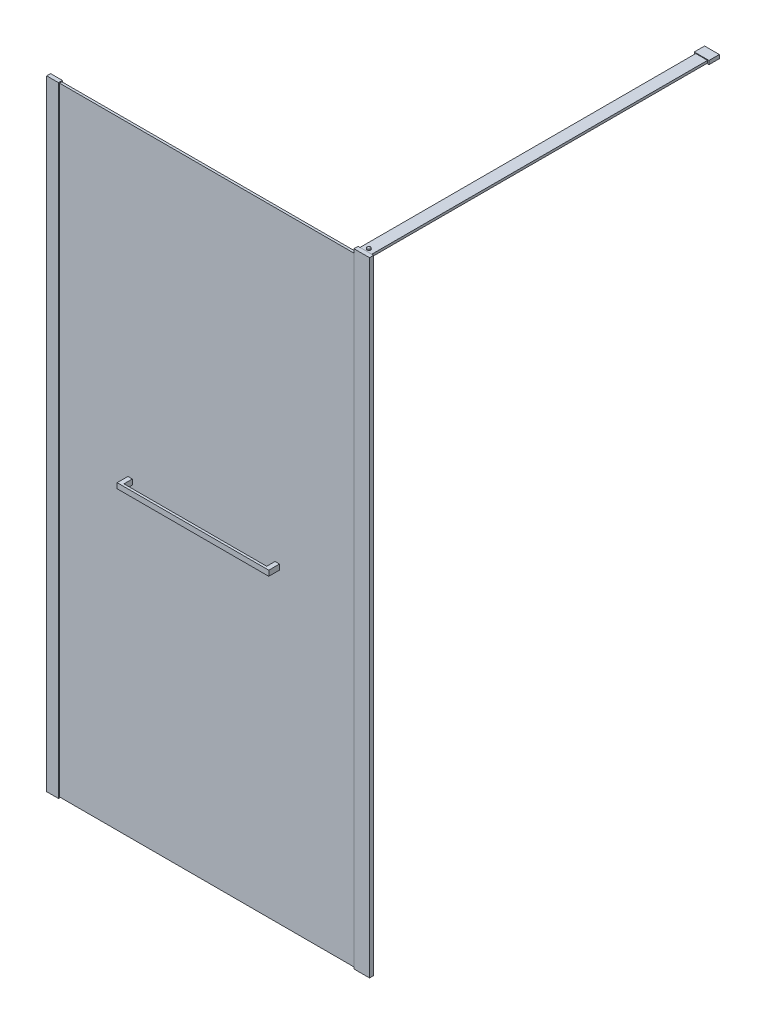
ISO-10303-21;
HEADER;
FILE_DESCRIPTION(('STEP AP214'),'2;1');
FILE_NAME('part.step','',(''),(''),'','','');
FILE_SCHEMA(('AUTOMOTIVE_DESIGN { 1 0 10303 214 1 1 1 1 }'));
ENDSEC;
DATA;
#1=APPLICATION_CONTEXT('core data for automotive mechanical design processes');
#2=APPLICATION_PROTOCOL_DEFINITION('international standard','automotive_design',2000,#1);
#3=PRODUCT_CONTEXT('',#1,'mechanical');
#4=PRODUCT('Part','Part','',(#3));
#5=PRODUCT_RELATED_PRODUCT_CATEGORY('part','',(#4));
#6=PRODUCT_DEFINITION_FORMATION('','',#4);
#7=PRODUCT_DEFINITION_CONTEXT('part definition',#1,'design');
#8=PRODUCT_DEFINITION('design','',#6,#7);
#9=PRODUCT_DEFINITION_SHAPE('','',#8);
#10=(LENGTH_UNIT() NAMED_UNIT(*) SI_UNIT(.MILLI.,.METRE.));
#11=(NAMED_UNIT(*) PLANE_ANGLE_UNIT() SI_UNIT($,.RADIAN.));
#12=(NAMED_UNIT(*) SI_UNIT($,.STERADIAN.) SOLID_ANGLE_UNIT());
#13=UNCERTAINTY_MEASURE_WITH_UNIT(LENGTH_MEASURE(1.E-05),#10,'distance_accuracy_value','');
#14=(GEOMETRIC_REPRESENTATION_CONTEXT(3) GLOBAL_UNCERTAINTY_ASSIGNED_CONTEXT((#13)) GLOBAL_UNIT_ASSIGNED_CONTEXT((#10,
#11,#12)) REPRESENTATION_CONTEXT('',''));
#15=CARTESIAN_POINT('',(0.,0.,0.));
#16=DIRECTION('',(0.,0.,1.));
#17=DIRECTION('',(1.,0.,0.));
#18=AXIS2_PLACEMENT_3D('',#15,#16,#17);
#19=CARTESIAN_POINT('',(287.5,1062.,-21.4));
#20=DIRECTION('',(1.,0.,0.));
#21=DIRECTION('',(0.,0.,-1.));
#22=AXIS2_PLACEMENT_3D('',#19,#20,#21);
#23=PLANE('',#22);
#24=DIRECTION('',(0.,1.,0.));
#25=VECTOR('',#24,1.);
#26=CARTESIAN_POINT('',(287.5,1062.,25.1));
#27=LINE('',#26,#25);
#28=CARTESIAN_POINT('',(287.5,1044.,25.1));
#29=VERTEX_POINT('',#28);
#30=CARTESIAN_POINT('',(287.5,1062.,25.1));
#31=VERTEX_POINT('',#30);
#32=EDGE_CURVE('E63',#29,#31,#27,.T.);
#33=ORIENTED_EDGE('',*,*,#32,.F.);
#34=DIRECTION('',(0.,0.,1.));
#35=VECTOR('',#34,1.);
#36=CARTESIAN_POINT('',(287.5,1044.,-21.4));
#37=LINE('',#36,#35);
#38=CARTESIAN_POINT('',(287.5,1044.,-21.4));
#39=VERTEX_POINT('',#38);
#40=EDGE_CURVE('E12',#39,#29,#37,.T.);
#41=ORIENTED_EDGE('',*,*,#40,.F.);
#42=DIRECTION('',(0.,1.,0.));
#43=VECTOR('',#42,1.);
#44=CARTESIAN_POINT('',(287.5,1062.,-21.4));
#45=LINE('',#44,#43);
#46=CARTESIAN_POINT('',(287.5,1062.,-21.4));
#47=VERTEX_POINT('',#46);
#48=EDGE_CURVE('E193',#39,#47,#45,.T.);
#49=ORIENTED_EDGE('',*,*,#48,.T.);
#50=DIRECTION('',(0.,0.,1.));
#51=VECTOR('',#50,1.);
#52=CARTESIAN_POINT('',(287.5,1062.,-21.4));
#53=LINE('',#52,#51);
#54=EDGE_CURVE('E176',#47,#31,#53,.T.);
#55=ORIENTED_EDGE('',*,*,#54,.T.);
#56=EDGE_LOOP('',(#33,#41,#49,#55));
#57=FACE_BOUND('',#56,.T.);
#58=ADVANCED_FACE('F46',(#57),#23,.T.);
#59=CARTESIAN_POINT('',(272.5,1044.,-21.4));
#60=DIRECTION('',(0.,-1.,0.));
#61=DIRECTION('',(0.,0.,-1.));
#62=AXIS2_PLACEMENT_3D('',#59,#60,#61);
#63=PLANE('',#62);
#64=ORIENTED_EDGE('',*,*,#40,.T.);
#65=DIRECTION('',(-1.,0.,0.));
#66=VECTOR('',#65,1.);
#67=CARTESIAN_POINT('',(792.197715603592,1044.,25.1));
#68=LINE('',#67,#66);
#69=CARTESIAN_POINT('',(772.5,1044.,25.1));
#70=VERTEX_POINT('',#69);
#71=EDGE_CURVE('E166',#70,#29,#68,.T.);
#72=ORIENTED_EDGE('',*,*,#71,.F.);
#73=DIRECTION('',(0.,0.,1.));
#74=VECTOR('',#73,1.);
#75=CARTESIAN_POINT('',(772.5,1044.,-21.4));
#76=LINE('',#75,#74);
#77=CARTESIAN_POINT('',(772.5,1044.,-21.4));
#78=VERTEX_POINT('',#77);
#79=EDGE_CURVE('E149',#78,#70,#76,.T.);
#80=ORIENTED_EDGE('',*,*,#79,.F.);
#81=DIRECTION('',(1.,0.,0.));
#82=VECTOR('',#81,1.);
#83=CARTESIAN_POINT('',(772.5,1044.,-21.4));
#84=LINE('',#83,#82);
#85=CARTESIAN_POINT('',(787.5,1044.,-21.4));
#86=VERTEX_POINT('',#85);
#87=EDGE_CURVE('E131',#78,#86,#84,.T.);
#88=ORIENTED_EDGE('',*,*,#87,.T.);
#89=DIRECTION('',(0.,0.,1.));
#90=VECTOR('',#89,1.);
#91=CARTESIAN_POINT('',(787.5,1044.,-21.4));
#92=LINE('',#91,#90);
#93=CARTESIAN_POINT('',(787.5,1044.,33.1));
#94=VERTEX_POINT('',#93);
#95=EDGE_CURVE('E147',#86,#94,#92,.T.);
#96=ORIENTED_EDGE('',*,*,#95,.T.);
#97=DIRECTION('',(1.,0.,0.));
#98=VECTOR('',#97,1.);
#99=CARTESIAN_POINT('',(272.5,1044.,33.1));
#100=LINE('',#99,#98);
#101=CARTESIAN_POINT('',(272.5,1044.,33.1));
#102=VERTEX_POINT('',#101);
#103=EDGE_CURVE('E135',#102,#94,#100,.T.);
#104=ORIENTED_EDGE('',*,*,#103,.F.);
#105=DIRECTION('',(0.,0.,1.));
#106=VECTOR('',#105,1.);
#107=CARTESIAN_POINT('',(272.5,1044.,-21.4));
#108=LINE('',#107,#106);
#109=CARTESIAN_POINT('',(272.5,1044.,-21.4));
#110=VERTEX_POINT('',#109);
#111=EDGE_CURVE('E55',#110,#102,#108,.T.);
#112=ORIENTED_EDGE('',*,*,#111,.F.);
#113=DIRECTION('',(1.,0.,0.));
#114=VECTOR('',#113,1.);
#115=CARTESIAN_POINT('',(272.5,1044.,-21.4));
#116=LINE('',#115,#114);
#117=EDGE_CURVE('E181',#110,#39,#116,.T.);
#118=ORIENTED_EDGE('',*,*,#117,.T.);
#119=EDGE_LOOP('',(#64,#72,#80,#88,#96,#104,#112,#118));
#120=FACE_BOUND('',#119,.T.);
#121=ADVANCED_FACE('F197',(#120),#63,.T.);
#122=CARTESIAN_POINT('',(272.5,1062.,-21.4));
#123=DIRECTION('',(-1.,0.,0.));
#124=DIRECTION('',(0.,0.,1.));
#125=AXIS2_PLACEMENT_3D('',#122,#123,#124);
#126=PLANE('',#125);
#127=ORIENTED_EDGE('',*,*,#111,.T.);
#128=DIRECTION('',(0.,-1.,0.));
#129=VECTOR('',#128,1.);
#130=CARTESIAN_POINT('',(272.5,1062.,33.1));
#131=LINE('',#130,#129);
#132=CARTESIAN_POINT('',(272.5,1062.,33.1));
#133=VERTEX_POINT('',#132);
#134=EDGE_CURVE('E121',#133,#102,#131,.T.);
#135=ORIENTED_EDGE('',*,*,#134,.F.);
#136=DIRECTION('',(0.,0.,1.));
#137=VECTOR('',#136,1.);
#138=CARTESIAN_POINT('',(272.5,1062.,-21.4));
#139=LINE('',#138,#137);
#140=CARTESIAN_POINT('',(272.5,1062.,-21.4));
#141=VERTEX_POINT('',#140);
#142=EDGE_CURVE('E116',#141,#133,#139,.T.);
#143=ORIENTED_EDGE('',*,*,#142,.F.);
#144=DIRECTION('',(0.,-1.,0.));
#145=VECTOR('',#144,1.);
#146=CARTESIAN_POINT('',(272.5,1062.,-21.4));
#147=LINE('',#146,#145);
#148=EDGE_CURVE('E186',#141,#110,#147,.T.);
#149=ORIENTED_EDGE('',*,*,#148,.T.);
#150=EDGE_LOOP('',(#127,#135,#143,#149));
#151=FACE_BOUND('',#150,.T.);
#152=ADVANCED_FACE('F218',(#151),#126,.T.);
#153=CARTESIAN_POINT('',(272.5,1062.,-21.4));
#154=DIRECTION('',(0.,1.,0.));
#155=DIRECTION('',(0.,0.,1.));
#156=AXIS2_PLACEMENT_3D('',#153,#154,#155);
#157=PLANE('',#156);
#158=ORIENTED_EDGE('',*,*,#142,.T.);
#159=DIRECTION('',(-1.,0.,0.));
#160=VECTOR('',#159,1.);
#161=CARTESIAN_POINT('',(272.5,1062.,33.1));
#162=LINE('',#161,#160);
#163=CARTESIAN_POINT('',(787.5,1062.,33.1));
#164=VERTEX_POINT('',#163);
#165=EDGE_CURVE('E109',#164,#133,#162,.T.);
#166=ORIENTED_EDGE('',*,*,#165,.F.);
#167=DIRECTION('',(0.,0.,1.));
#168=VECTOR('',#167,1.);
#169=CARTESIAN_POINT('',(787.5,1062.,-21.4));
#170=LINE('',#169,#168);
#171=CARTESIAN_POINT('',(787.5,1062.,-21.4));
#172=VERTEX_POINT('',#171);
#173=EDGE_CURVE('E113',#172,#164,#170,.T.);
#174=ORIENTED_EDGE('',*,*,#173,.F.);
#175=DIRECTION('',(-1.,0.,0.));
#176=VECTOR('',#175,1.);
#177=CARTESIAN_POINT('',(772.5,1062.,-21.4));
#178=LINE('',#177,#176);
#179=CARTESIAN_POINT('',(772.5,1062.,-21.4));
#180=VERTEX_POINT('',#179);
#181=EDGE_CURVE('E138',#172,#180,#178,.T.);
#182=ORIENTED_EDGE('',*,*,#181,.T.);
#183=DIRECTION('',(0.,0.,1.));
#184=VECTOR('',#183,1.);
#185=CARTESIAN_POINT('',(772.5,1062.,-21.4));
#186=LINE('',#185,#184);
#187=CARTESIAN_POINT('',(772.5,1062.,25.1));
#188=VERTEX_POINT('',#187);
#189=EDGE_CURVE('E130',#180,#188,#186,.T.);
#190=ORIENTED_EDGE('',*,*,#189,.T.);
#191=DIRECTION('',(-1.,0.,0.));
#192=VECTOR('',#191,1.);
#193=CARTESIAN_POINT('',(792.197715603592,1062.,25.1));
#194=LINE('',#193,#192);
#195=EDGE_CURVE('E163',#188,#31,#194,.T.);
#196=ORIENTED_EDGE('',*,*,#195,.T.);
#197=ORIENTED_EDGE('',*,*,#54,.F.);
#198=DIRECTION('',(-1.,0.,0.));
#199=VECTOR('',#198,1.);
#200=CARTESIAN_POINT('',(272.5,1062.,-21.4));
#201=LINE('',#200,#199);
#202=EDGE_CURVE('E190',#47,#141,#201,.T.);
#203=ORIENTED_EDGE('',*,*,#202,.T.);
#204=EDGE_LOOP('',(#158,#166,#174,#182,#190,#196,#197,#203));
#205=FACE_BOUND('',#204,.T.);
#206=ADVANCED_FACE('F111',(#205),#157,.T.);
#207=CARTESIAN_POINT('',(287.5,1044.,-21.4));
#208=DIRECTION('',(0.,0.,1.));
#209=DIRECTION('',(1.,0.,0.));
#210=AXIS2_PLACEMENT_3D('',#207,#208,#209);
#211=PLANE('',#210);
#212=ORIENTED_EDGE('',*,*,#48,.F.);
#213=ORIENTED_EDGE('',*,*,#117,.F.);
#214=ORIENTED_EDGE('',*,*,#148,.F.);
#215=ORIENTED_EDGE('',*,*,#202,.F.);
#216=EDGE_LOOP('',(#212,#213,#214,#215));
#217=FACE_BOUND('',#216,.T.);
#218=ADVANCED_FACE('F225',(#217),#211,.F.);
#219=CARTESIAN_POINT('',(287.5,1044.,33.1));
#220=DIRECTION('',(0.,0.,1.));
#221=DIRECTION('',(1.,0.,0.));
#222=AXIS2_PLACEMENT_3D('',#219,#220,#221);
#223=PLANE('',#222);
#224=ORIENTED_EDGE('',*,*,#103,.T.);
#225=DIRECTION('',(0.,1.,0.));
#226=VECTOR('',#225,1.);
#227=CARTESIAN_POINT('',(787.5,1062.,33.1));
#228=LINE('',#227,#226);
#229=EDGE_CURVE('E127',#94,#164,#228,.T.);
#230=ORIENTED_EDGE('',*,*,#229,.T.);
#231=ORIENTED_EDGE('',*,*,#165,.T.);
#232=ORIENTED_EDGE('',*,*,#134,.T.);
#233=EDGE_LOOP('',(#224,#230,#231,#232));
#234=FACE_BOUND('',#233,.T.);
#235=ADVANCED_FACE('F133',(#234),#223,.T.);
#236=CARTESIAN_POINT('',(792.197715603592,1062.,25.1));
#237=DIRECTION('',(0.,0.,1.));
#238=DIRECTION('',(1.,0.,0.));
#239=AXIS2_PLACEMENT_3D('',#236,#237,#238);
#240=PLANE('',#239);
#241=ORIENTED_EDGE('',*,*,#195,.F.);
#242=DIRECTION('',(0.,-1.,0.));
#243=VECTOR('',#242,1.);
#244=CARTESIAN_POINT('',(772.5,1062.,25.1));
#245=LINE('',#244,#243);
#246=EDGE_CURVE('E49',#188,#70,#245,.T.);
#247=ORIENTED_EDGE('',*,*,#246,.T.);
#248=ORIENTED_EDGE('',*,*,#71,.T.);
#249=ORIENTED_EDGE('',*,*,#32,.T.);
#250=EDGE_LOOP('',(#241,#247,#248,#249));
#251=FACE_BOUND('',#250,.T.);
#252=ADVANCED_FACE('F203',(#251),#240,.F.);
#253=CARTESIAN_POINT('',(772.5,1062.,-21.4));
#254=DIRECTION('',(-1.,0.,0.));
#255=DIRECTION('',(0.,0.,1.));
#256=AXIS2_PLACEMENT_3D('',#253,#254,#255);
#257=PLANE('',#256);
#258=ORIENTED_EDGE('',*,*,#246,.F.);
#259=ORIENTED_EDGE('',*,*,#189,.F.);
#260=DIRECTION('',(0.,-1.,0.));
#261=VECTOR('',#260,1.);
#262=CARTESIAN_POINT('',(772.5,1062.,-21.4));
#263=LINE('',#262,#261);
#264=EDGE_CURVE('E142',#180,#78,#263,.T.);
#265=ORIENTED_EDGE('',*,*,#264,.T.);
#266=ORIENTED_EDGE('',*,*,#79,.T.);
#267=EDGE_LOOP('',(#258,#259,#265,#266));
#268=FACE_BOUND('',#267,.T.);
#269=ADVANCED_FACE('F204',(#268),#257,.T.);
#270=CARTESIAN_POINT('',(787.5,1062.,-21.4));
#271=DIRECTION('',(1.,0.,0.));
#272=DIRECTION('',(0.,0.,-1.));
#273=AXIS2_PLACEMENT_3D('',#270,#271,#272);
#274=PLANE('',#273);
#275=ORIENTED_EDGE('',*,*,#173,.T.);
#276=ORIENTED_EDGE('',*,*,#229,.F.);
#277=ORIENTED_EDGE('',*,*,#95,.F.);
#278=DIRECTION('',(0.,1.,0.));
#279=VECTOR('',#278,1.);
#280=CARTESIAN_POINT('',(787.5,1062.,-21.4));
#281=LINE('',#280,#279);
#282=EDGE_CURVE('E129',#86,#172,#281,.T.);
#283=ORIENTED_EDGE('',*,*,#282,.T.);
#284=EDGE_LOOP('',(#275,#276,#277,#283));
#285=FACE_BOUND('',#284,.T.);
#286=ADVANCED_FACE('F126',(#285),#274,.T.);
#287=CARTESIAN_POINT('',(787.5,1044.,-21.4));
#288=DIRECTION('',(0.,0.,1.));
#289=DIRECTION('',(1.,0.,0.));
#290=AXIS2_PLACEMENT_3D('',#287,#288,#289);
#291=PLANE('',#290);
#292=ORIENTED_EDGE('',*,*,#282,.F.);
#293=ORIENTED_EDGE('',*,*,#87,.F.);
#294=ORIENTED_EDGE('',*,*,#264,.F.);
#295=ORIENTED_EDGE('',*,*,#181,.F.);
#296=EDGE_LOOP('',(#292,#293,#294,#295));
#297=FACE_BOUND('',#296,.T.);
#298=ADVANCED_FACE('F200',(#297),#291,.F.);
#299=CLOSED_SHELL('',(#58,#121,#152,#206,#218,#235,#252,#269,#286,#298));
#300=MANIFOLD_SOLID_BREP('B2',#299);
#301=CARTESIAN_POINT('',(1089.9,2119.,-1184.4));
#302=DIRECTION('',(-1.,0.,0.));
#303=DIRECTION('',(0.,0.,1.));
#304=AXIS2_PLACEMENT_3D('',#301,#302,#303);
#305=PLANE('',#304);
#306=DIRECTION('',(0.,-1.,0.));
#307=VECTOR('',#306,1.);
#308=CARTESIAN_POINT('',(1089.9,2119.,-1155.));
#309=LINE('',#308,#307);
#310=CARTESIAN_POINT('',(1089.9,2119.,-1155.));
#311=VERTEX_POINT('',#310);
#312=CARTESIAN_POINT('',(1089.9,2111.,-1155.));
#313=VERTEX_POINT('',#312);
#314=EDGE_CURVE('E417',#311,#313,#309,.T.);
#315=ORIENTED_EDGE('',*,*,#314,.F.);
#316=DIRECTION('',(0.,0.,1.));
#317=VECTOR('',#316,1.);
#318=CARTESIAN_POINT('',(1089.9,2119.,-1184.4));
#319=LINE('',#318,#317);
#320=CARTESIAN_POINT('',(1089.9,2119.,-14.4));
#321=VERTEX_POINT('',#320);
#322=EDGE_CURVE('E432',#311,#321,#319,.T.);
#323=ORIENTED_EDGE('',*,*,#322,.T.);
#324=DIRECTION('',(0.,-1.,0.));
#325=VECTOR('',#324,1.);
#326=CARTESIAN_POINT('',(1089.9,2119.,-14.4));
#327=LINE('',#326,#325);
#328=CARTESIAN_POINT('',(1089.9,2111.,-14.4));
#329=VERTEX_POINT('',#328);
#330=EDGE_CURVE('E420',#321,#329,#327,.T.);
#331=ORIENTED_EDGE('',*,*,#330,.T.);
#332=DIRECTION('',(0.,0.,1.));
#333=VECTOR('',#332,1.);
#334=CARTESIAN_POINT('',(1089.9,2111.,-1184.4));
#335=LINE('',#334,#333);
#336=EDGE_CURVE('E327',#313,#329,#335,.T.);
#337=ORIENTED_EDGE('',*,*,#336,.F.);
#338=EDGE_LOOP('',(#315,#323,#331,#337));
#339=FACE_BOUND('',#338,.T.);
#340=ADVANCED_FACE('F319',(#339),#305,.F.);
#341=CARTESIAN_POINT('',(1089.9,2111.,-1184.4));
#342=DIRECTION('',(0.,1.,0.));
#343=DIRECTION('',(0.,0.,1.));
#344=AXIS2_PLACEMENT_3D('',#341,#342,#343);
#345=PLANE('',#344);
#346=DIRECTION('',(-1.,0.,0.));
#347=VECTOR('',#346,1.);
#348=CARTESIAN_POINT('',(1089.9,2111.,-1155.));
#349=LINE('',#348,#347);
#350=CARTESIAN_POINT('',(1049.9,2111.,-1155.));
#351=VERTEX_POINT('',#350);
#352=EDGE_CURVE('E334',#313,#351,#349,.T.);
#353=ORIENTED_EDGE('',*,*,#352,.F.);
#354=ORIENTED_EDGE('',*,*,#336,.T.);
#355=DIRECTION('',(-1.,0.,0.));
#356=VECTOR('',#355,1.);
#357=CARTESIAN_POINT('',(1089.9,2111.,-14.4));
#358=LINE('',#357,#356);
#359=CARTESIAN_POINT('',(1049.9,2111.,-14.4));
#360=VERTEX_POINT('',#359);
#361=EDGE_CURVE('E423',#329,#360,#358,.T.);
#362=ORIENTED_EDGE('',*,*,#361,.T.);
#363=DIRECTION('',(0.,0.,1.));
#364=VECTOR('',#363,1.);
#365=CARTESIAN_POINT('',(1049.9,2111.,-1184.4));
#366=LINE('',#365,#364);
#367=EDGE_CURVE('E436',#351,#360,#366,.T.);
#368=ORIENTED_EDGE('',*,*,#367,.F.);
#369=EDGE_LOOP('',(#353,#354,#362,#368));
#370=FACE_BOUND('',#369,.T.);
#371=ADVANCED_FACE('F438',(#370),#345,.F.);
#372=CARTESIAN_POINT('',(1049.9,2119.,-1184.4));
#373=DIRECTION('',(1.,0.,0.));
#374=DIRECTION('',(0.,0.,-1.));
#375=AXIS2_PLACEMENT_3D('',#372,#373,#374);
#376=PLANE('',#375);
#377=DIRECTION('',(0.,1.,0.));
#378=VECTOR('',#377,1.);
#379=CARTESIAN_POINT('',(1049.9,2119.,-1155.));
#380=LINE('',#379,#378);
#381=CARTESIAN_POINT('',(1049.9,2119.,-1155.));
#382=VERTEX_POINT('',#381);
#383=EDGE_CURVE('E342',#351,#382,#380,.T.);
#384=ORIENTED_EDGE('',*,*,#383,.F.);
#385=ORIENTED_EDGE('',*,*,#367,.T.);
#386=DIRECTION('',(0.,1.,0.));
#387=VECTOR('',#386,1.);
#388=CARTESIAN_POINT('',(1049.9,2119.,-14.4));
#389=LINE('',#388,#387);
#390=CARTESIAN_POINT('',(1049.9,2119.,-14.4));
#391=VERTEX_POINT('',#390);
#392=EDGE_CURVE('E426',#360,#391,#389,.T.);
#393=ORIENTED_EDGE('',*,*,#392,.T.);
#394=DIRECTION('',(0.,0.,1.));
#395=VECTOR('',#394,1.);
#396=CARTESIAN_POINT('',(1049.9,2119.,-1184.4));
#397=LINE('',#396,#395);
#398=EDGE_CURVE('E434',#382,#391,#397,.T.);
#399=ORIENTED_EDGE('',*,*,#398,.F.);
#400=EDGE_LOOP('',(#384,#385,#393,#399));
#401=FACE_BOUND('',#400,.T.);
#402=ADVANCED_FACE('F448',(#401),#376,.F.);
#403=CARTESIAN_POINT('',(1089.9,2119.,-1184.4));
#404=DIRECTION('',(0.,-1.,0.));
#405=DIRECTION('',(0.,0.,-1.));
#406=AXIS2_PLACEMENT_3D('',#403,#404,#405);
#407=PLANE('',#406);
#408=CARTESIAN_POINT('',(1069.9,2119.,-24.3999999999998));
#409=DIRECTION('',(0.,-1.,0.));
#410=DIRECTION('',(0.,0.,-1.));
#411=AXIS2_PLACEMENT_3D('',#408,#409,#410);
#412=CIRCLE('',#411,5.90000000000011);
#413=CARTESIAN_POINT('',(1069.9,2119.,-30.2999999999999));
#414=VERTEX_POINT('',#413);
#415=EDGE_CURVE('E511',#414,#414,#412,.T.);
#416=ORIENTED_EDGE('',*,*,#415,.T.);
#417=EDGE_LOOP('',(#416));
#418=FACE_BOUND('',#417,.T.);
#419=DIRECTION('',(1.,0.,0.));
#420=VECTOR('',#419,1.);
#421=CARTESIAN_POINT('',(1089.9,2119.,-1155.));
#422=LINE('',#421,#420);
#423=EDGE_CURVE('E44',#382,#311,#422,.T.);
#424=ORIENTED_EDGE('',*,*,#423,.F.);
#425=ORIENTED_EDGE('',*,*,#398,.T.);
#426=DIRECTION('',(1.,0.,0.));
#427=VECTOR('',#426,1.);
#428=CARTESIAN_POINT('',(1089.9,2119.,-14.4));
#429=LINE('',#428,#427);
#430=EDGE_CURVE('E429',#391,#321,#429,.T.);
#431=ORIENTED_EDGE('',*,*,#430,.T.);
#432=ORIENTED_EDGE('',*,*,#322,.F.);
#433=EDGE_LOOP('',(#424,#425,#431,#432));
#434=FACE_BOUND('',#433,.T.);
#435=ADVANCED_FACE('F447',(#418,#434),#407,.F.);
#436=CARTESIAN_POINT('',(1089.9,2111.,-14.4));
#437=DIRECTION('',(0.,0.,-1.));
#438=DIRECTION('',(-1.,0.,0.));
#439=AXIS2_PLACEMENT_3D('',#436,#437,#438);
#440=PLANE('',#439);
#441=ORIENTED_EDGE('',*,*,#330,.F.);
#442=ORIENTED_EDGE('',*,*,#430,.F.);
#443=ORIENTED_EDGE('',*,*,#392,.F.);
#444=ORIENTED_EDGE('',*,*,#361,.F.);
#445=EDGE_LOOP('',(#441,#442,#443,#444));
#446=FACE_BOUND('',#445,.T.);
#447=ADVANCED_FACE('F444',(#446),#440,.F.);
#448=CARTESIAN_POINT('',(1044.9,2108.75,-1155.));
#449=DIRECTION('',(0.,0.,-1.));
#450=DIRECTION('',(-1.,0.,0.));
#451=AXIS2_PLACEMENT_3D('',#448,#449,#450);
#452=PLANE('',#451);
#453=DIRECTION('',(0.,1.,0.));
#454=VECTOR('',#453,1.);
#455=CARTESIAN_POINT('',(1044.9,2121.25,-1155.));
#456=LINE('',#455,#454);
#457=CARTESIAN_POINT('',(1044.9,2108.75,-1155.));
#458=VERTEX_POINT('',#457);
#459=CARTESIAN_POINT('',(1044.9,2121.25,-1155.));
#460=VERTEX_POINT('',#459);
#461=EDGE_CURVE('E409',#458,#460,#456,.T.);
#462=ORIENTED_EDGE('',*,*,#461,.F.);
#463=DIRECTION('',(-1.,0.,0.));
#464=VECTOR('',#463,1.);
#465=CARTESIAN_POINT('',(1094.9,2108.75,-1155.));
#466=LINE('',#465,#464);
#467=CARTESIAN_POINT('',(1094.9,2108.75,-1155.));
#468=VERTEX_POINT('',#467);
#469=EDGE_CURVE('E405',#468,#458,#466,.T.);
#470=ORIENTED_EDGE('',*,*,#469,.F.);
#471=DIRECTION('',(0.,-1.,0.));
#472=VECTOR('',#471,1.);
#473=CARTESIAN_POINT('',(1094.9,2121.25,-1155.));
#474=LINE('',#473,#472);
#475=CARTESIAN_POINT('',(1094.9,2121.25,-1155.));
#476=VERTEX_POINT('',#475);
#477=EDGE_CURVE('E492',#476,#468,#474,.T.);
#478=ORIENTED_EDGE('',*,*,#477,.F.);
#479=DIRECTION('',(1.,0.,0.));
#480=VECTOR('',#479,1.);
#481=CARTESIAN_POINT('',(1094.9,2121.25,-1155.));
#482=LINE('',#481,#480);
#483=EDGE_CURVE('E495',#460,#476,#482,.T.);
#484=ORIENTED_EDGE('',*,*,#483,.F.);
#485=EDGE_LOOP('',(#462,#470,#478,#484));
#486=FACE_BOUND('',#485,.T.);
#487=ORIENTED_EDGE('',*,*,#423,.T.);
#488=ORIENTED_EDGE('',*,*,#314,.T.);
#489=ORIENTED_EDGE('',*,*,#352,.T.);
#490=ORIENTED_EDGE('',*,*,#383,.T.);
#491=EDGE_LOOP('',(#487,#488,#489,#490));
#492=FACE_BOUND('',#491,.T.);
#493=ADVANCED_FACE('F450',(#486,#492),#452,.F.);
#494=CARTESIAN_POINT('',(1044.9,2121.25,-1190.));
#495=DIRECTION('',(1.,0.,0.));
#496=DIRECTION('',(0.,0.,-1.));
#497=AXIS2_PLACEMENT_3D('',#494,#495,#496);
#498=PLANE('',#497);
#499=ORIENTED_EDGE('',*,*,#461,.T.);
#500=DIRECTION('',(0.,0.,1.));
#501=VECTOR('',#500,1.);
#502=CARTESIAN_POINT('',(1044.9,2121.25,-1190.));
#503=LINE('',#502,#501);
#504=CARTESIAN_POINT('',(1044.9,2121.25,-1190.));
#505=VERTEX_POINT('',#504);
#506=EDGE_CURVE('E389',#505,#460,#503,.T.);
#507=ORIENTED_EDGE('',*,*,#506,.F.);
#508=DIRECTION('',(0.,1.,0.));
#509=VECTOR('',#508,1.);
#510=CARTESIAN_POINT('',(1044.9,2121.25,-1190.));
#511=LINE('',#510,#509);
#512=CARTESIAN_POINT('',(1044.9,2108.75,-1190.));
#513=VERTEX_POINT('',#512);
#514=EDGE_CURVE('E396',#513,#505,#511,.T.);
#515=ORIENTED_EDGE('',*,*,#514,.F.);
#516=DIRECTION('',(0.,0.,1.));
#517=VECTOR('',#516,1.);
#518=CARTESIAN_POINT('',(1044.9,2108.75,-1190.));
#519=LINE('',#518,#517);
#520=EDGE_CURVE('E489',#513,#458,#519,.T.);
#521=ORIENTED_EDGE('',*,*,#520,.T.);
#522=EDGE_LOOP('',(#499,#507,#515,#521));
#523=FACE_BOUND('',#522,.T.);
#524=ADVANCED_FACE('F407',(#523),#498,.F.);
#525=CARTESIAN_POINT('',(1094.9,2121.25,-1190.));
#526=DIRECTION('',(0.,-1.,0.));
#527=DIRECTION('',(0.,0.,-1.));
#528=AXIS2_PLACEMENT_3D('',#525,#526,#527);
#529=PLANE('',#528);
#530=ORIENTED_EDGE('',*,*,#483,.T.);
#531=DIRECTION('',(0.,0.,1.));
#532=VECTOR('',#531,1.);
#533=CARTESIAN_POINT('',(1094.9,2121.25,-1190.));
#534=LINE('',#533,#532);
#535=CARTESIAN_POINT('',(1094.9,2121.25,-1190.));
#536=VERTEX_POINT('',#535);
#537=EDGE_CURVE('E392',#536,#476,#534,.T.);
#538=ORIENTED_EDGE('',*,*,#537,.F.);
#539=DIRECTION('',(1.,0.,0.));
#540=VECTOR('',#539,1.);
#541=CARTESIAN_POINT('',(1094.9,2121.25,-1190.));
#542=LINE('',#541,#540);
#543=EDGE_CURVE('E385',#505,#536,#542,.T.);
#544=ORIENTED_EDGE('',*,*,#543,.F.);
#545=ORIENTED_EDGE('',*,*,#506,.T.);
#546=EDGE_LOOP('',(#530,#538,#544,#545));
#547=FACE_BOUND('',#546,.T.);
#548=ADVANCED_FACE('F387',(#547),#529,.F.);
#549=CARTESIAN_POINT('',(1094.9,2121.25,-1190.));
#550=DIRECTION('',(-1.,0.,0.));
#551=DIRECTION('',(0.,0.,1.));
#552=AXIS2_PLACEMENT_3D('',#549,#550,#551);
#553=PLANE('',#552);
#554=ORIENTED_EDGE('',*,*,#477,.T.);
#555=DIRECTION('',(0.,0.,1.));
#556=VECTOR('',#555,1.);
#557=CARTESIAN_POINT('',(1094.9,2108.75,-1190.));
#558=LINE('',#557,#556);
#559=CARTESIAN_POINT('',(1094.9,2108.75,-1190.));
#560=VERTEX_POINT('',#559);
#561=EDGE_CURVE('E412',#560,#468,#558,.T.);
#562=ORIENTED_EDGE('',*,*,#561,.F.);
#563=DIRECTION('',(0.,-1.,0.));
#564=VECTOR('',#563,1.);
#565=CARTESIAN_POINT('',(1094.9,2121.25,-1190.));
#566=LINE('',#565,#564);
#567=EDGE_CURVE('E395',#536,#560,#566,.T.);
#568=ORIENTED_EDGE('',*,*,#567,.F.);
#569=ORIENTED_EDGE('',*,*,#537,.T.);
#570=EDGE_LOOP('',(#554,#562,#568,#569));
#571=FACE_BOUND('',#570,.T.);
#572=ADVANCED_FACE('F477',(#571),#553,.F.);
#573=CARTESIAN_POINT('',(1094.9,2108.75,-1190.));
#574=DIRECTION('',(0.,1.,0.));
#575=DIRECTION('',(0.,0.,1.));
#576=AXIS2_PLACEMENT_3D('',#573,#574,#575);
#577=PLANE('',#576);
#578=ORIENTED_EDGE('',*,*,#469,.T.);
#579=ORIENTED_EDGE('',*,*,#520,.F.);
#580=DIRECTION('',(-1.,0.,0.));
#581=VECTOR('',#580,1.);
#582=CARTESIAN_POINT('',(1094.9,2108.75,-1190.));
#583=LINE('',#582,#581);
#584=EDGE_CURVE('E401',#560,#513,#583,.T.);
#585=ORIENTED_EDGE('',*,*,#584,.F.);
#586=ORIENTED_EDGE('',*,*,#561,.T.);
#587=EDGE_LOOP('',(#578,#579,#585,#586));
#588=FACE_BOUND('',#587,.T.);
#589=ADVANCED_FACE('F479',(#588),#577,.F.);
#590=CARTESIAN_POINT('',(1044.9,2108.75,-1190.));
#591=DIRECTION('',(0.,0.,-1.));
#592=DIRECTION('',(-1.,0.,0.));
#593=AXIS2_PLACEMENT_3D('',#590,#591,#592);
#594=PLANE('',#593);
#595=ORIENTED_EDGE('',*,*,#514,.T.);
#596=ORIENTED_EDGE('',*,*,#543,.T.);
#597=ORIENTED_EDGE('',*,*,#567,.T.);
#598=ORIENTED_EDGE('',*,*,#584,.T.);
#599=EDGE_LOOP('',(#595,#596,#597,#598));
#600=FACE_BOUND('',#599,.T.);
#601=ADVANCED_FACE('F399',(#600),#594,.T.);
#602=CARTESIAN_POINT('',(1069.9,2115.34934210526,-24.3999999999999));
#603=DIRECTION('',(0.,-1.,0.));
#604=DIRECTION('',(0.,0.,-1.));
#605=AXIS2_PLACEMENT_3D('',#602,#603,#604);
#606=SPHERICAL_SURFACE('',#605,9.35065789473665);
#607=CARTESIAN_POINT('',(1069.9,2122.8,-24.3999999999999));
#608=DIRECTION('',(0.,-1.,0.));
#609=DIRECTION('',(0.,0.,-1.));
#610=AXIS2_PLACEMENT_3D('',#607,#608,#609);
#611=CIRCLE('',#610,5.65000000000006);
#612=CARTESIAN_POINT('',(1069.9,2122.8,-30.0499999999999));
#613=VERTEX_POINT('',#612);
#614=EDGE_CURVE('E508',#613,#613,#611,.T.);
#615=ORIENTED_EDGE('',*,*,#614,.F.);
#616=EDGE_LOOP('',(#615));
#617=FACE_BOUND('',#616,.T.);
#618=ADVANCED_FACE('F486',(#617),#606,.T.);
#619=CARTESIAN_POINT('',(1069.9,2119.,-24.3999999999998));
#620=DIRECTION('',(0.,-1.,0.));
#621=DIRECTION('',(0.,0.,-1.));
#622=AXIS2_PLACEMENT_3D('',#619,#620,#621);
#623=CONICAL_SURFACE('',#622,5.90000000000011,0.0656948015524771);
#624=ORIENTED_EDGE('',*,*,#614,.T.);
#625=EDGE_LOOP('',(#624));
#626=FACE_BOUND('',#625,.T.);
#627=ORIENTED_EDGE('',*,*,#415,.F.);
#628=EDGE_LOOP('',(#627));
#629=FACE_BOUND('',#628,.T.);
#630=ADVANCED_FACE('F515',(#626,#629),#623,.T.);
#631=CLOSED_SHELL('',(#340,#371,#402,#435,#447,#493,#524,#548,#572,#589,#601,#618,#630));
#632=CARTESIAN_POINT('',(1069.9,2122.53567623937,-24.3999999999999));
#633=DIRECTION('',(0.,-1.,0.));
#634=DIRECTION('',(0.,0.,-1.));
#635=AXIS2_PLACEMENT_3D('',#632,#633,#634);
#636=CONICAL_SURFACE('',#635,5.1663088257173,0.0656948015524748);
#637=CARTESIAN_POINT('',(1069.9,2119.,-24.3999999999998));
#638=DIRECTION('',(0.,-1.,0.));
#639=DIRECTION('',(0.,0.,-1.));
#640=AXIS2_PLACEMENT_3D('',#637,#638,#639);
#641=CIRCLE('',#640,5.398919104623);
#642=CARTESIAN_POINT('',(1069.9,2119.,-29.7989191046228));
#643=VERTEX_POINT('',#642);
#644=EDGE_CURVE('E496',#643,#643,#641,.T.);
#645=ORIENTED_EDGE('',*,*,#644,.T.);
#646=EDGE_LOOP('',(#645));
#647=FACE_BOUND('',#646,.T.);
#648=CARTESIAN_POINT('',(1069.9,2122.53567623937,-24.3999999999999));
#649=DIRECTION('',(0.,-1.,0.));
#650=DIRECTION('',(0.,0.,-1.));
#651=AXIS2_PLACEMENT_3D('',#648,#649,#650);
#652=CIRCLE('',#651,5.1663088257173);
#653=CARTESIAN_POINT('',(1069.9,2122.53567623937,-29.5663088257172));
#654=VERTEX_POINT('',#653);
#655=EDGE_CURVE('E500',#654,#654,#652,.T.);
#656=ORIENTED_EDGE('',*,*,#655,.F.);
#657=EDGE_LOOP('',(#656));
#658=FACE_BOUND('',#657,.T.);
#659=ADVANCED_FACE('F529',(#647,#658),#636,.F.);
#660=CARTESIAN_POINT('',(1069.9,2115.34934210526,-24.3999999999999));
#661=DIRECTION('',(0.,-1.,0.));
#662=DIRECTION('',(0.,0.,1.));
#663=AXIS2_PLACEMENT_3D('',#660,#661,#662);
#664=SPHERICAL_SURFACE('',#663,8.85065789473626);
#665=ORIENTED_EDGE('',*,*,#655,.T.);
#666=EDGE_LOOP('',(#665));
#667=FACE_BOUND('',#666,.T.);
#668=ADVANCED_FACE('F526',(#667),#664,.F.);
#669=ORIENTED_EDGE('',*,*,#644,.F.);
#670=EDGE_LOOP('',(#669));
#671=FACE_BOUND('',#670,.T.);
#672=ADVANCED_FACE('F473',(#671),#407,.F.);
#673=CLOSED_SHELL('',(#659,#668,#672));
#674=ORIENTED_CLOSED_SHELL('',*,#673,.T.);
#675=BREP_WITH_VOIDS('B6',#631,(#674));
#676=CARTESIAN_POINT('',(1096.4,2111.,-0.399999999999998));
#677=DIRECTION('',(0.,-1.,0.));
#678=DIRECTION('',(0.,0.,-1.));
#679=AXIS2_PLACEMENT_3D('',#676,#677,#678);
#680=PLANE('',#679);
#681=DIRECTION('',(-1.,0.,0.));
#682=VECTOR('',#681,1.);
#683=CARTESIAN_POINT('',(1043.4,2111.,-11.4));
#684=LINE('',#683,#682);
#685=CARTESIAN_POINT('',(1044.7,2111.,-11.4));
#686=VERTEX_POINT('',#685);
#687=CARTESIAN_POINT('',(1043.4,2111.,-11.4));
#688=VERTEX_POINT('',#687);
#689=EDGE_CURVE('E781',#686,#688,#684,.T.);
#690=ORIENTED_EDGE('',*,*,#689,.F.);
#691=DIRECTION('',(0.,0.,1.));
#692=VECTOR('',#691,1.);
#693=CARTESIAN_POINT('',(1044.7,2111.,-0.399999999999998));
#694=LINE('',#693,#692);
#695=CARTESIAN_POINT('',(1044.7,2111.,-3.39999999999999));
#696=VERTEX_POINT('',#695);
#697=EDGE_CURVE('E647',#686,#696,#694,.T.);
#698=ORIENTED_EDGE('',*,*,#697,.T.);
#699=DIRECTION('',(1.,0.,0.));
#700=VECTOR('',#699,1.);
#701=CARTESIAN_POINT('',(1053.5,2111.,-3.39999999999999));
#702=LINE('',#701,#700);
#703=CARTESIAN_POINT('',(1043.4,2111.,-3.39999999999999));
#704=VERTEX_POINT('',#703);
#705=EDGE_CURVE('E785',#704,#696,#702,.T.);
#706=ORIENTED_EDGE('',*,*,#705,.F.);
#707=DIRECTION('',(0.,0.,1.));
#708=VECTOR('',#707,1.);
#709=CARTESIAN_POINT('',(1043.4,2111.,-14.4));
#710=LINE('',#709,#708);
#711=EDGE_CURVE('E762',#688,#704,#710,.T.);
#712=ORIENTED_EDGE('',*,*,#711,.F.);
#713=EDGE_LOOP('',(#690,#698,#706,#712));
#714=FACE_BOUND('',#713,.T.);
#715=ADVANCED_FACE('F638',(#714),#680,.T.);
#716=CARTESIAN_POINT('',(1053.5,2111.,-3.39999999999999));
#717=DIRECTION('',(0.,0.,-1.));
#718=DIRECTION('',(-1.,0.,0.));
#719=AXIS2_PLACEMENT_3D('',#716,#717,#718);
#720=PLANE('',#719);
#721=DIRECTION('',(-1.,0.,0.));
#722=VECTOR('',#721,1.);
#723=CARTESIAN_POINT('',(1053.5,2103.2,-3.39999999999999));
#724=LINE('',#723,#722);
#725=CARTESIAN_POINT('',(1053.5,2103.2,-3.39999999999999));
#726=VERTEX_POINT('',#725);
#727=CARTESIAN_POINT('',(1044.7,2103.2,-3.39999999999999));
#728=VERTEX_POINT('',#727);
#729=EDGE_CURVE('E760',#726,#728,#724,.T.);
#730=ORIENTED_EDGE('',*,*,#729,.F.);
#731=DIRECTION('',(0.,-1.,0.));
#732=VECTOR('',#731,1.);
#733=CARTESIAN_POINT('',(1053.5,2111.,-3.39999999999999));
#734=LINE('',#733,#732);
#735=CARTESIAN_POINT('',(1053.5,3.,-3.39999999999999));
#736=VERTEX_POINT('',#735);
#737=EDGE_CURVE('E784',#726,#736,#734,.T.);
#738=ORIENTED_EDGE('',*,*,#737,.T.);
#739=DIRECTION('',(1.,0.,0.));
#740=VECTOR('',#739,1.);
#741=CARTESIAN_POINT('',(1053.5,3.,-3.39999999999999));
#742=LINE('',#741,#740);
#743=CARTESIAN_POINT('',(1043.4,3.,-3.39999999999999));
#744=VERTEX_POINT('',#743);
#745=EDGE_CURVE('E772',#744,#736,#742,.T.);
#746=ORIENTED_EDGE('',*,*,#745,.F.);
#747=DIRECTION('',(0.,-1.,0.));
#748=VECTOR('',#747,1.);
#749=CARTESIAN_POINT('',(1043.4,2111.,-3.39999999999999));
#750=LINE('',#749,#748);
#751=EDGE_CURVE('E663',#704,#744,#750,.T.);
#752=ORIENTED_EDGE('',*,*,#751,.F.);
#753=ORIENTED_EDGE('',*,*,#705,.T.);
#754=DIRECTION('',(0.,-1.,0.));
#755=VECTOR('',#754,1.);
#756=CARTESIAN_POINT('',(1044.7,2111.,-3.39999999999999));
#757=LINE('',#756,#755);
#758=EDGE_CURVE('E655',#696,#728,#757,.T.);
#759=ORIENTED_EDGE('',*,*,#758,.T.);
#760=EDGE_LOOP('',(#730,#738,#746,#752,#753,#759));
#761=FACE_BOUND('',#760,.T.);
#762=ADVANCED_FACE('F640',(#761),#720,.T.);
#763=CARTESIAN_POINT('',(1043.4,2111.,-3.39999999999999));
#764=DIRECTION('',(-1.,0.,0.));
#765=DIRECTION('',(0.,0.,1.));
#766=AXIS2_PLACEMENT_3D('',#763,#764,#765);
#767=PLANE('',#766);
#768=DIRECTION('',(0.,-1.,0.));
#769=VECTOR('',#768,1.);
#770=CARTESIAN_POINT('',(1043.4,2111.,-14.4));
#771=LINE('',#770,#769);
#772=CARTESIAN_POINT('',(1043.4,2119.,-14.4));
#773=VERTEX_POINT('',#772);
#774=CARTESIAN_POINT('',(1043.4,0.,-14.4));
#775=VERTEX_POINT('',#774);
#776=EDGE_CURVE('E719',#773,#775,#771,.T.);
#777=ORIENTED_EDGE('',*,*,#776,.T.);
#778=DIRECTION('',(0.,0.,-1.));
#779=VECTOR('',#778,1.);
#780=CARTESIAN_POINT('',(1043.4,0.,-0.399999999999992));
#781=LINE('',#780,#779);
#782=CARTESIAN_POINT('',(1043.4,0.,-0.399999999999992));
#783=VERTEX_POINT('',#782);
#784=EDGE_CURVE('E723',#783,#775,#781,.T.);
#785=ORIENTED_EDGE('',*,*,#784,.F.);
#786=DIRECTION('',(0.,-1.,0.));
#787=VECTOR('',#786,1.);
#788=CARTESIAN_POINT('',(1043.4,2111.,-0.399999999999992));
#789=LINE('',#788,#787);
#790=CARTESIAN_POINT('',(1043.4,2119.,-0.399999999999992));
#791=VERTEX_POINT('',#790);
#792=EDGE_CURVE('E793',#791,#783,#789,.T.);
#793=ORIENTED_EDGE('',*,*,#792,.F.);
#794=DIRECTION('',(0.,0.,1.));
#795=VECTOR('',#794,1.);
#796=CARTESIAN_POINT('',(1043.4,2119.,-14.4));
#797=LINE('',#796,#795);
#798=EDGE_CURVE('E725',#773,#791,#797,.T.);
#799=ORIENTED_EDGE('',*,*,#798,.F.);
#800=EDGE_LOOP('',(#777,#785,#793,#799));
#801=FACE_BOUND('',#800,.T.);
#802=ORIENTED_EDGE('',*,*,#751,.T.);
#803=DIRECTION('',(0.,0.,-1.));
#804=VECTOR('',#803,1.);
#805=CARTESIAN_POINT('',(1043.4,3.,-0.399999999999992));
#806=LINE('',#805,#804);
#807=CARTESIAN_POINT('',(1043.4,3.,-11.4));
#808=VERTEX_POINT('',#807);
#809=EDGE_CURVE('E744',#744,#808,#806,.T.);
#810=ORIENTED_EDGE('',*,*,#809,.T.);
#811=DIRECTION('',(0.,-1.,0.));
#812=VECTOR('',#811,1.);
#813=CARTESIAN_POINT('',(1043.4,2111.,-11.4));
#814=LINE('',#813,#812);
#815=EDGE_CURVE('E730',#688,#808,#814,.T.);
#816=ORIENTED_EDGE('',*,*,#815,.F.);
#817=ORIENTED_EDGE('',*,*,#711,.T.);
#818=EDGE_LOOP('',(#802,#810,#816,#817));
#819=FACE_BOUND('',#818,.T.);
#820=ADVANCED_FACE('F721',(#801,#819),#767,.T.);
#821=CARTESIAN_POINT('',(1043.4,2111.,-0.399999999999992));
#822=DIRECTION('',(0.,0.,1.));
#823=DIRECTION('',(1.,0.,0.));
#824=AXIS2_PLACEMENT_3D('',#821,#822,#823);
#825=PLANE('',#824);
#826=ORIENTED_EDGE('',*,*,#792,.T.);
#827=DIRECTION('',(-1.,0.,0.));
#828=VECTOR('',#827,1.);
#829=CARTESIAN_POINT('',(1043.4,0.,-0.399999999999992));
#830=LINE('',#829,#828);
#831=CARTESIAN_POINT('',(1096.4,0.,-0.399999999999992));
#832=VERTEX_POINT('',#831);
#833=EDGE_CURVE('E743',#832,#783,#830,.T.);
#834=ORIENTED_EDGE('',*,*,#833,.F.);
#835=DIRECTION('',(0.,-1.,0.));
#836=VECTOR('',#835,1.);
#837=CARTESIAN_POINT('',(1096.4,2111.,-0.399999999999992));
#838=LINE('',#837,#836);
#839=CARTESIAN_POINT('',(1096.4,2119.,-0.399999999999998));
#840=VERTEX_POINT('',#839);
#841=EDGE_CURVE('E795',#840,#832,#838,.T.);
#842=ORIENTED_EDGE('',*,*,#841,.F.);
#843=DIRECTION('',(1.,0.,0.));
#844=VECTOR('',#843,1.);
#845=CARTESIAN_POINT('',(1096.4,2119.,-0.399999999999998));
#846=LINE('',#845,#844);
#847=EDGE_CURVE('E769',#791,#840,#846,.T.);
#848=ORIENTED_EDGE('',*,*,#847,.F.);
#849=EDGE_LOOP('',(#826,#834,#842,#848));
#850=FACE_BOUND('',#849,.T.);
#851=ADVANCED_FACE('F822',(#850),#825,.T.);
#852=CARTESIAN_POINT('',(1096.4,2111.,-0.399999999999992));
#853=DIRECTION('',(1.,0.,0.));
#854=DIRECTION('',(0.,0.,-1.));
#855=AXIS2_PLACEMENT_3D('',#852,#853,#854);
#856=PLANE('',#855);
#857=ORIENTED_EDGE('',*,*,#841,.T.);
#858=DIRECTION('',(0.,0.,1.));
#859=VECTOR('',#858,1.);
#860=CARTESIAN_POINT('',(1096.4,0.,-0.399999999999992));
#861=LINE('',#860,#859);
#862=CARTESIAN_POINT('',(1096.4,0.,-14.4));
#863=VERTEX_POINT('',#862);
#864=EDGE_CURVE('E738',#863,#832,#861,.T.);
#865=ORIENTED_EDGE('',*,*,#864,.F.);
#866=DIRECTION('',(0.,-1.,0.));
#867=VECTOR('',#866,1.);
#868=CARTESIAN_POINT('',(1096.4,2111.,-14.4));
#869=LINE('',#868,#867);
#870=CARTESIAN_POINT('',(1096.4,2119.,-14.4));
#871=VERTEX_POINT('',#870);
#872=EDGE_CURVE('E729',#871,#863,#869,.T.);
#873=ORIENTED_EDGE('',*,*,#872,.F.);
#874=DIRECTION('',(0.,0.,-1.));
#875=VECTOR('',#874,1.);
#876=CARTESIAN_POINT('',(1096.4,2119.,-14.4));
#877=LINE('',#876,#875);
#878=EDGE_CURVE('E763',#840,#871,#877,.T.);
#879=ORIENTED_EDGE('',*,*,#878,.F.);
#880=EDGE_LOOP('',(#857,#865,#873,#879));
#881=FACE_BOUND('',#880,.T.);
#882=ADVANCED_FACE('F828',(#881),#856,.T.);
#883=CARTESIAN_POINT('',(1096.4,2111.,-14.4));
#884=DIRECTION('',(0.,0.,-1.));
#885=DIRECTION('',(-1.,0.,0.));
#886=AXIS2_PLACEMENT_3D('',#883,#884,#885);
#887=PLANE('',#886);
#888=ORIENTED_EDGE('',*,*,#872,.T.);
#889=DIRECTION('',(1.,0.,0.));
#890=VECTOR('',#889,1.);
#891=CARTESIAN_POINT('',(1043.4,0.,-14.4));
#892=LINE('',#891,#890);
#893=EDGE_CURVE('E733',#775,#863,#892,.T.);
#894=ORIENTED_EDGE('',*,*,#893,.F.);
#895=ORIENTED_EDGE('',*,*,#776,.F.);
#896=DIRECTION('',(-1.,0.,0.));
#897=VECTOR('',#896,1.);
#898=CARTESIAN_POINT('',(1096.4,2119.,-14.4));
#899=LINE('',#898,#897);
#900=EDGE_CURVE('E766',#871,#773,#899,.T.);
#901=ORIENTED_EDGE('',*,*,#900,.F.);
#902=EDGE_LOOP('',(#888,#894,#895,#901));
#903=FACE_BOUND('',#902,.T.);
#904=ADVANCED_FACE('F734',(#903),#887,.T.);
#905=CARTESIAN_POINT('',(1043.4,2111.,-11.4));
#906=DIRECTION('',(0.,0.,1.));
#907=DIRECTION('',(1.,0.,0.));
#908=AXIS2_PLACEMENT_3D('',#905,#906,#907);
#909=PLANE('',#908);
#910=DIRECTION('',(1.,0.,0.));
#911=VECTOR('',#910,1.);
#912=CARTESIAN_POINT('',(1043.4,2103.2,-11.4));
#913=LINE('',#912,#911);
#914=CARTESIAN_POINT('',(1044.7,2103.2,-11.4));
#915=VERTEX_POINT('',#914);
#916=CARTESIAN_POINT('',(1053.5,2103.2,-11.4));
#917=VERTEX_POINT('',#916);
#918=EDGE_CURVE('E758',#915,#917,#913,.T.);
#919=ORIENTED_EDGE('',*,*,#918,.F.);
#920=DIRECTION('',(0.,1.,0.));
#921=VECTOR('',#920,1.);
#922=CARTESIAN_POINT('',(1044.7,2111.,-11.4));
#923=LINE('',#922,#921);
#924=EDGE_CURVE('E754',#915,#686,#923,.T.);
#925=ORIENTED_EDGE('',*,*,#924,.T.);
#926=ORIENTED_EDGE('',*,*,#689,.T.);
#927=ORIENTED_EDGE('',*,*,#815,.T.);
#928=DIRECTION('',(-1.,0.,0.));
#929=VECTOR('',#928,1.);
#930=CARTESIAN_POINT('',(1043.4,3.,-11.4));
#931=LINE('',#930,#929);
#932=CARTESIAN_POINT('',(1053.5,3.,-11.4));
#933=VERTEX_POINT('',#932);
#934=EDGE_CURVE('E789',#933,#808,#931,.T.);
#935=ORIENTED_EDGE('',*,*,#934,.F.);
#936=DIRECTION('',(0.,-1.,0.));
#937=VECTOR('',#936,1.);
#938=CARTESIAN_POINT('',(1053.5,2111.,-11.4));
#939=LINE('',#938,#937);
#940=EDGE_CURVE('E798',#917,#933,#939,.T.);
#941=ORIENTED_EDGE('',*,*,#940,.F.);
#942=EDGE_LOOP('',(#919,#925,#926,#927,#935,#941));
#943=FACE_BOUND('',#942,.T.);
#944=ADVANCED_FACE('F811',(#943),#909,.T.);
#945=CARTESIAN_POINT('',(1053.5,2111.,-11.4));
#946=DIRECTION('',(-1.,0.,0.));
#947=DIRECTION('',(0.,0.,1.));
#948=AXIS2_PLACEMENT_3D('',#945,#946,#947);
#949=PLANE('',#948);
#950=DIRECTION('',(0.,0.,1.));
#951=VECTOR('',#950,1.);
#952=CARTESIAN_POINT('',(1053.5,2103.2,-11.4));
#953=LINE('',#952,#951);
#954=EDGE_CURVE('E316',#917,#726,#953,.T.);
#955=ORIENTED_EDGE('',*,*,#954,.F.);
#956=ORIENTED_EDGE('',*,*,#940,.T.);
#957=DIRECTION('',(0.,0.,-1.));
#958=VECTOR('',#957,1.);
#959=CARTESIAN_POINT('',(1053.5,3.,-11.4));
#960=LINE('',#959,#958);
#961=EDGE_CURVE('E778',#736,#933,#960,.T.);
#962=ORIENTED_EDGE('',*,*,#961,.F.);
#963=ORIENTED_EDGE('',*,*,#737,.F.);
#964=EDGE_LOOP('',(#955,#956,#962,#963));
#965=FACE_BOUND('',#964,.T.);
#966=ADVANCED_FACE('F842',(#965),#949,.T.);
#967=CARTESIAN_POINT('',(1096.4,2119.,-0.399999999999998));
#968=DIRECTION('',(0.,-1.,0.));
#969=DIRECTION('',(0.,0.,-1.));
#970=AXIS2_PLACEMENT_3D('',#967,#968,#969);
#971=PLANE('',#970);
#972=ORIENTED_EDGE('',*,*,#878,.T.);
#973=ORIENTED_EDGE('',*,*,#900,.T.);
#974=ORIENTED_EDGE('',*,*,#798,.T.);
#975=ORIENTED_EDGE('',*,*,#847,.T.);
#976=EDGE_LOOP('',(#972,#973,#974,#975));
#977=FACE_BOUND('',#976,.T.);
#978=ADVANCED_FACE('F838',(#977),#971,.F.);
#979=CARTESIAN_POINT('',(1059.7,2103.2,-3.34999999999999));
#980=DIRECTION('',(0.,-1.,0.));
#981=DIRECTION('',(0.,0.,-1.));
#982=AXIS2_PLACEMENT_3D('',#979,#980,#981);
#983=PLANE('',#982);
#984=ORIENTED_EDGE('',*,*,#954,.T.);
#985=ORIENTED_EDGE('',*,*,#729,.T.);
#986=DIRECTION('',(0.,0.,1.));
#987=VECTOR('',#986,1.);
#988=CARTESIAN_POINT('',(1044.7,2103.2,-3.34999999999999));
#989=LINE('',#988,#987);
#990=EDGE_CURVE('E750',#915,#728,#989,.T.);
#991=ORIENTED_EDGE('',*,*,#990,.F.);
#992=ORIENTED_EDGE('',*,*,#918,.T.);
#993=EDGE_LOOP('',(#984,#985,#991,#992));
#994=FACE_BOUND('',#993,.T.);
#995=ADVANCED_FACE('F841',(#994),#983,.T.);
#996=CARTESIAN_POINT('',(1044.7,2103.2,-3.34999999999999));
#997=DIRECTION('',(1.,0.,0.));
#998=DIRECTION('',(0.,0.,-1.));
#999=AXIS2_PLACEMENT_3D('',#996,#997,#998);
#1000=PLANE('',#999);
#1001=ORIENTED_EDGE('',*,*,#758,.F.);
#1002=ORIENTED_EDGE('',*,*,#697,.F.);
#1003=ORIENTED_EDGE('',*,*,#924,.F.);
#1004=ORIENTED_EDGE('',*,*,#990,.T.);
#1005=EDGE_LOOP('',(#1001,#1002,#1003,#1004));
#1006=FACE_BOUND('',#1005,.T.);
#1007=ADVANCED_FACE('F846',(#1006),#1000,.F.);
#1008=CARTESIAN_POINT('',(1043.4,3.,-14.4));
#1009=DIRECTION('',(0.,-1.,0.));
#1010=DIRECTION('',(0.,0.,-1.));
#1011=AXIS2_PLACEMENT_3D('',#1008,#1009,#1010);
#1012=PLANE('',#1011);
#1013=ORIENTED_EDGE('',*,*,#809,.F.);
#1014=ORIENTED_EDGE('',*,*,#745,.T.);
#1015=ORIENTED_EDGE('',*,*,#961,.T.);
#1016=ORIENTED_EDGE('',*,*,#934,.T.);
#1017=EDGE_LOOP('',(#1013,#1014,#1015,#1016));
#1018=FACE_BOUND('',#1017,.T.);
#1019=ADVANCED_FACE('F818',(#1018),#1012,.F.);
#1020=CARTESIAN_POINT('',(1043.4,0.,-14.4));
#1021=DIRECTION('',(0.,-1.,0.));
#1022=DIRECTION('',(0.,0.,-1.));
#1023=AXIS2_PLACEMENT_3D('',#1020,#1021,#1022);
#1024=PLANE('',#1023);
#1025=ORIENTED_EDGE('',*,*,#784,.T.);
#1026=ORIENTED_EDGE('',*,*,#893,.T.);
#1027=ORIENTED_EDGE('',*,*,#864,.T.);
#1028=ORIENTED_EDGE('',*,*,#833,.T.);
#1029=EDGE_LOOP('',(#1025,#1026,#1027,#1028));
#1030=FACE_BOUND('',#1029,.T.);
#1031=ADVANCED_FACE('F741',(#1030),#1024,.T.);
#1032=CLOSED_SHELL('',(#715,#762,#820,#851,#882,#904,#944,#966,#978,#995,#1007,#1019,#1031));
#1033=MANIFOLD_SOLID_BREP('B38',#1032);
#1034=CARTESIAN_POINT('',(6.5,2103.,-3.39999999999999));
#1035=DIRECTION('',(-1.,0.,0.));
#1036=DIRECTION('',(0.,0.,1.));
#1037=AXIS2_PLACEMENT_3D('',#1034,#1035,#1036);
#1038=PLANE('',#1037);
#1039=DIRECTION('',(0.,0.,-1.));
#1040=VECTOR('',#1039,1.);
#1041=CARTESIAN_POINT('',(6.5,3.,-3.39999999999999));
#1042=LINE('',#1041,#1040);
#1043=CARTESIAN_POINT('',(6.5,3.,-3.39999999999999));
#1044=VERTEX_POINT('',#1043);
#1045=CARTESIAN_POINT('',(6.5,3.,-11.4));
#1046=VERTEX_POINT('',#1045);
#1047=EDGE_CURVE('E1045',#1044,#1046,#1042,.T.);
#1048=ORIENTED_EDGE('',*,*,#1047,.F.);
#1049=DIRECTION('',(0.,-1.,0.));
#1050=VECTOR('',#1049,1.);
#1051=CARTESIAN_POINT('',(6.5,2103.,-3.39999999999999));
#1052=LINE('',#1051,#1050);
#1053=CARTESIAN_POINT('',(6.5,2103.,-3.39999999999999));
#1054=VERTEX_POINT('',#1053);
#1055=EDGE_CURVE('E636',#1054,#1044,#1052,.T.);
#1056=ORIENTED_EDGE('',*,*,#1055,.F.);
#1057=DIRECTION('',(0.,0.,-1.));
#1058=VECTOR('',#1057,1.);
#1059=CARTESIAN_POINT('',(6.5,2103.,-3.39999999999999));
#1060=LINE('',#1059,#1058);
#1061=CARTESIAN_POINT('',(6.5,2103.,-11.4));
#1062=VERTEX_POINT('',#1061);
#1063=EDGE_CURVE('E1039',#1054,#1062,#1060,.T.);
#1064=ORIENTED_EDGE('',*,*,#1063,.T.);
#1065=DIRECTION('',(0.,-1.,0.));
#1066=VECTOR('',#1065,1.);
#1067=CARTESIAN_POINT('',(6.5,2103.,-11.4));
#1068=LINE('',#1067,#1066);
#1069=EDGE_CURVE('E984',#1062,#1046,#1068,.T.);
#1070=ORIENTED_EDGE('',*,*,#1069,.T.);
#1071=EDGE_LOOP('',(#1048,#1056,#1064,#1070));
#1072=FACE_BOUND('',#1071,.T.);
#1073=ADVANCED_FACE('F981',(#1072),#1038,.T.);
#1074=CARTESIAN_POINT('',(6.5,2103.,-3.39999999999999));
#1075=DIRECTION('',(0.,0.,1.));
#1076=DIRECTION('',(1.,0.,0.));
#1077=AXIS2_PLACEMENT_3D('',#1074,#1075,#1076);
#1078=PLANE('',#1077);
#1079=DIRECTION('',(-1.,0.,0.));
#1080=VECTOR('',#1079,1.);
#1081=CARTESIAN_POINT('',(6.5,3.,-3.39999999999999));
#1082=LINE('',#1081,#1080);
#1083=CARTESIAN_POINT('',(1053.5,3.,-3.39999999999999));
#1084=VERTEX_POINT('',#1083);
#1085=EDGE_CURVE('E1041',#1084,#1044,#1082,.T.);
#1086=ORIENTED_EDGE('',*,*,#1085,.F.);
#1087=DIRECTION('',(0.,-1.,0.));
#1088=VECTOR('',#1087,1.);
#1089=CARTESIAN_POINT('',(1053.5,2103.,-3.39999999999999));
#1090=LINE('',#1089,#1088);
#1091=CARTESIAN_POINT('',(1053.5,2103.,-3.39999999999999));
#1092=VERTEX_POINT('',#1091);
#1093=EDGE_CURVE('E990',#1092,#1084,#1090,.T.);
#1094=ORIENTED_EDGE('',*,*,#1093,.F.);
#1095=DIRECTION('',(-1.,0.,0.));
#1096=VECTOR('',#1095,1.);
#1097=CARTESIAN_POINT('',(6.5,2103.,-3.39999999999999));
#1098=LINE('',#1097,#1096);
#1099=EDGE_CURVE('E1036',#1092,#1054,#1098,.T.);
#1100=ORIENTED_EDGE('',*,*,#1099,.T.);
#1101=ORIENTED_EDGE('',*,*,#1055,.T.);
#1102=EDGE_LOOP('',(#1086,#1094,#1100,#1101));
#1103=FACE_BOUND('',#1102,.T.);
#1104=ADVANCED_FACE('F1055',(#1103),#1078,.T.);
#1105=CARTESIAN_POINT('',(1053.5,2103.,-3.39999999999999));
#1106=DIRECTION('',(1.,0.,0.));
#1107=DIRECTION('',(0.,0.,-1.));
#1108=AXIS2_PLACEMENT_3D('',#1105,#1106,#1107);
#1109=PLANE('',#1108);
#1110=DIRECTION('',(0.,0.,1.));
#1111=VECTOR('',#1110,1.);
#1112=CARTESIAN_POINT('',(1053.5,3.,-3.39999999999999));
#1113=LINE('',#1112,#1111);
#1114=CARTESIAN_POINT('',(1053.5,3.,-11.4));
#1115=VERTEX_POINT('',#1114);
#1116=EDGE_CURVE('E1031',#1115,#1084,#1113,.T.);
#1117=ORIENTED_EDGE('',*,*,#1116,.F.);
#1118=DIRECTION('',(0.,-1.,0.));
#1119=VECTOR('',#1118,1.);
#1120=CARTESIAN_POINT('',(1053.5,2103.,-11.4));
#1121=LINE('',#1120,#1119);
#1122=CARTESIAN_POINT('',(1053.5,2103.,-11.4));
#1123=VERTEX_POINT('',#1122);
#1124=EDGE_CURVE('E1026',#1123,#1115,#1121,.T.);
#1125=ORIENTED_EDGE('',*,*,#1124,.F.);
#1126=DIRECTION('',(0.,0.,1.));
#1127=VECTOR('',#1126,1.);
#1128=CARTESIAN_POINT('',(1053.5,2103.,-3.39999999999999));
#1129=LINE('',#1128,#1127);
#1130=EDGE_CURVE('E1029',#1123,#1092,#1129,.T.);
#1131=ORIENTED_EDGE('',*,*,#1130,.T.);
#1132=ORIENTED_EDGE('',*,*,#1093,.T.);
#1133=EDGE_LOOP('',(#1117,#1125,#1131,#1132));
#1134=FACE_BOUND('',#1133,.T.);
#1135=ADVANCED_FACE('F1028',(#1134),#1109,.T.);
#1136=CARTESIAN_POINT('',(6.5,2103.,-11.4));
#1137=DIRECTION('',(0.,0.,-1.));
#1138=DIRECTION('',(-1.,0.,0.));
#1139=AXIS2_PLACEMENT_3D('',#1136,#1137,#1138);
#1140=PLANE('',#1139);
#1141=DIRECTION('',(1.,0.,0.));
#1142=VECTOR('',#1141,1.);
#1143=CARTESIAN_POINT('',(6.5,3.,-11.4));
#1144=LINE('',#1143,#1142);
#1145=EDGE_CURVE('E1048',#1046,#1115,#1144,.T.);
#1146=ORIENTED_EDGE('',*,*,#1145,.F.);
#1147=ORIENTED_EDGE('',*,*,#1069,.F.);
#1148=DIRECTION('',(1.,0.,0.));
#1149=VECTOR('',#1148,1.);
#1150=CARTESIAN_POINT('',(6.5,2103.,-11.4));
#1151=LINE('',#1150,#1149);
#1152=EDGE_CURVE('E1035',#1062,#1123,#1151,.T.);
#1153=ORIENTED_EDGE('',*,*,#1152,.T.);
#1154=ORIENTED_EDGE('',*,*,#1124,.T.);
#1155=EDGE_LOOP('',(#1146,#1147,#1153,#1154));
#1156=FACE_BOUND('',#1155,.T.);
#1157=ADVANCED_FACE('F1038',(#1156),#1140,.T.);
#1158=CARTESIAN_POINT('',(6.5,2103.,-11.4));
#1159=DIRECTION('',(0.,-1.,0.));
#1160=DIRECTION('',(0.,0.,-1.));
#1161=AXIS2_PLACEMENT_3D('',#1158,#1159,#1160);
#1162=PLANE('',#1161);
#1163=ORIENTED_EDGE('',*,*,#1063,.F.);
#1164=ORIENTED_EDGE('',*,*,#1099,.F.);
#1165=ORIENTED_EDGE('',*,*,#1130,.F.);
#1166=ORIENTED_EDGE('',*,*,#1152,.F.);
#1167=EDGE_LOOP('',(#1163,#1164,#1165,#1166));
#1168=FACE_BOUND('',#1167,.T.);
#1169=ADVANCED_FACE('F1034',(#1168),#1162,.F.);
#1170=CARTESIAN_POINT('',(6.5,3.,-11.4));
#1171=DIRECTION('',(0.,-1.,0.));
#1172=DIRECTION('',(0.,0.,-1.));
#1173=AXIS2_PLACEMENT_3D('',#1170,#1171,#1172);
#1174=PLANE('',#1173);
#1175=ORIENTED_EDGE('',*,*,#1047,.T.);
#1176=ORIENTED_EDGE('',*,*,#1145,.T.);
#1177=ORIENTED_EDGE('',*,*,#1116,.T.);
#1178=ORIENTED_EDGE('',*,*,#1085,.T.);
#1179=EDGE_LOOP('',(#1175,#1176,#1177,#1178));
#1180=FACE_BOUND('',#1179,.T.);
#1181=ADVANCED_FACE('F1054',(#1180),#1174,.T.);
#1182=CLOSED_SHELL('',(#1073,#1104,#1135,#1157,#1169,#1181));
#1183=MANIFOLD_SOLID_BREP('B310',#1182);
#1184=CARTESIAN_POINT('',(40.,2103.,0.));
#1185=DIRECTION('',(0.,0.,-1.));
#1186=DIRECTION('',(-1.,0.,0.));
#1187=AXIS2_PLACEMENT_3D('',#1184,#1185,#1186);
#1188=PLANE('',#1187);
#1189=DIRECTION('',(0.,-1.,0.));
#1190=VECTOR('',#1189,1.);
#1191=CARTESIAN_POINT('',(0.,2103.,0.));
#1192=LINE('',#1191,#1190);
#1193=CARTESIAN_POINT('',(0.,2106.,0.));
#1194=VERTEX_POINT('',#1193);
#1195=CARTESIAN_POINT('',(0.,0.,0.));
#1196=VERTEX_POINT('',#1195);
#1197=EDGE_CURVE('E1179',#1194,#1196,#1192,.T.);
#1198=ORIENTED_EDGE('',*,*,#1197,.T.);
#1199=DIRECTION('',(-1.,0.,0.));
#1200=VECTOR('',#1199,1.);
#1201=CARTESIAN_POINT('',(0.,0.,0.));
#1202=LINE('',#1201,#1200);
#1203=CARTESIAN_POINT('',(40.,0.,0.));
#1204=VERTEX_POINT('',#1203);
#1205=EDGE_CURVE('E1192',#1204,#1196,#1202,.T.);
#1206=ORIENTED_EDGE('',*,*,#1205,.F.);
#1207=DIRECTION('',(0.,-1.,0.));
#1208=VECTOR('',#1207,1.);
#1209=CARTESIAN_POINT('',(40.,2103.,0.));
#1210=LINE('',#1209,#1208);
#1211=CARTESIAN_POINT('',(40.,2106.,0.));
#1212=VERTEX_POINT('',#1211);
#1213=EDGE_CURVE('E979',#1212,#1204,#1210,.T.);
#1214=ORIENTED_EDGE('',*,*,#1213,.F.);
#1215=DIRECTION('',(1.,0.,0.));
#1216=VECTOR('',#1215,1.);
#1217=CARTESIAN_POINT('',(0.,2106.,0.));
#1218=LINE('',#1217,#1216);
#1219=EDGE_CURVE('E1204',#1194,#1212,#1218,.T.);
#1220=ORIENTED_EDGE('',*,*,#1219,.F.);
#1221=EDGE_LOOP('',(#1198,#1206,#1214,#1220));
#1222=FACE_BOUND('',#1221,.T.);
#1223=ADVANCED_FACE('F1105',(#1222),#1188,.F.);
#1224=CARTESIAN_POINT('',(6.5,2103.,-3.39999999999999));
#1225=DIRECTION('',(0.,0.,1.));
#1226=DIRECTION('',(1.,0.,0.));
#1227=AXIS2_PLACEMENT_3D('',#1224,#1225,#1226);
#1228=PLANE('',#1227);
#1229=DIRECTION('',(-1.,0.,0.));
#1230=VECTOR('',#1229,1.);
#1231=CARTESIAN_POINT('',(6.5,3.,-3.39999999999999));
#1232=LINE('',#1231,#1230);
#1233=CARTESIAN_POINT('',(40.,3.,-3.39999999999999));
#1234=VERTEX_POINT('',#1233);
#1235=CARTESIAN_POINT('',(6.5,3.,-3.39999999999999));
#1236=VERTEX_POINT('',#1235);
#1237=EDGE_CURVE('E1212',#1234,#1236,#1232,.T.);
#1238=ORIENTED_EDGE('',*,*,#1237,.T.);
#1239=DIRECTION('',(0.,-1.,0.));
#1240=VECTOR('',#1239,1.);
#1241=CARTESIAN_POINT('',(6.5,2103.,-3.39999999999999));
#1242=LINE('',#1241,#1240);
#1243=CARTESIAN_POINT('',(6.5,2103.,-3.39999999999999));
#1244=VERTEX_POINT('',#1243);
#1245=EDGE_CURVE('E1233',#1244,#1236,#1242,.T.);
#1246=ORIENTED_EDGE('',*,*,#1245,.F.);
#1247=DIRECTION('',(-1.,0.,0.));
#1248=VECTOR('',#1247,1.);
#1249=CARTESIAN_POINT('',(6.5,2103.,-3.39999999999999));
#1250=LINE('',#1249,#1248);
#1251=CARTESIAN_POINT('',(40.,2103.,-3.39999999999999));
#1252=VERTEX_POINT('',#1251);
#1253=EDGE_CURVE('E1221',#1252,#1244,#1250,.T.);
#1254=ORIENTED_EDGE('',*,*,#1253,.F.);
#1255=DIRECTION('',(0.,-1.,0.));
#1256=VECTOR('',#1255,1.);
#1257=CARTESIAN_POINT('',(40.,2103.,-3.39999999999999));
#1258=LINE('',#1257,#1256);
#1259=EDGE_CURVE('E1115',#1252,#1234,#1258,.T.);
#1260=ORIENTED_EDGE('',*,*,#1259,.T.);
#1261=EDGE_LOOP('',(#1238,#1246,#1254,#1260));
#1262=FACE_BOUND('',#1261,.T.);
#1263=ADVANCED_FACE('F1275',(#1262),#1228,.F.);
#1264=CARTESIAN_POINT('',(6.5,2103.,-11.4));
#1265=DIRECTION('',(-1.,0.,0.));
#1266=DIRECTION('',(0.,0.,1.));
#1267=AXIS2_PLACEMENT_3D('',#1264,#1265,#1266);
#1268=PLANE('',#1267);
#1269=DIRECTION('',(0.,0.,-1.));
#1270=VECTOR('',#1269,1.);
#1271=CARTESIAN_POINT('',(6.5,3.,-11.4));
#1272=LINE('',#1271,#1270);
#1273=CARTESIAN_POINT('',(6.5,3.,-11.4));
#1274=VERTEX_POINT('',#1273);
#1275=EDGE_CURVE('E1224',#1236,#1274,#1272,.T.);
#1276=ORIENTED_EDGE('',*,*,#1275,.T.);
#1277=DIRECTION('',(0.,-1.,0.));
#1278=VECTOR('',#1277,1.);
#1279=CARTESIAN_POINT('',(6.5,2103.,-11.4));
#1280=LINE('',#1279,#1278);
#1281=CARTESIAN_POINT('',(6.5,2103.,-11.4));
#1282=VERTEX_POINT('',#1281);
#1283=EDGE_CURVE('E1123',#1282,#1274,#1280,.T.);
#1284=ORIENTED_EDGE('',*,*,#1283,.F.);
#1285=DIRECTION('',(0.,0.,-1.));
#1286=VECTOR('',#1285,1.);
#1287=CARTESIAN_POINT('',(6.5,2103.,-11.4));
#1288=LINE('',#1287,#1286);
#1289=EDGE_CURVE('E1217',#1244,#1282,#1288,.T.);
#1290=ORIENTED_EDGE('',*,*,#1289,.F.);
#1291=ORIENTED_EDGE('',*,*,#1245,.T.);
#1292=EDGE_LOOP('',(#1276,#1284,#1290,#1291));
#1293=FACE_BOUND('',#1292,.T.);
#1294=ADVANCED_FACE('F1272',(#1293),#1268,.F.);
#1295=CARTESIAN_POINT('',(40.,2103.,-11.4));
#1296=DIRECTION('',(0.,0.,-1.));
#1297=DIRECTION('',(-1.,0.,0.));
#1298=AXIS2_PLACEMENT_3D('',#1295,#1296,#1297);
#1299=PLANE('',#1298);
#1300=DIRECTION('',(1.,0.,0.));
#1301=VECTOR('',#1300,1.);
#1302=CARTESIAN_POINT('',(40.,3.,-11.4));
#1303=LINE('',#1302,#1301);
#1304=CARTESIAN_POINT('',(40.,3.,-11.4));
#1305=VERTEX_POINT('',#1304);
#1306=EDGE_CURVE('E1108',#1274,#1305,#1303,.T.);
#1307=ORIENTED_EDGE('',*,*,#1306,.T.);
#1308=DIRECTION('',(0.,-1.,0.));
#1309=VECTOR('',#1308,1.);
#1310=CARTESIAN_POINT('',(40.,2103.,-11.4));
#1311=LINE('',#1310,#1309);
#1312=CARTESIAN_POINT('',(40.,2103.,-11.4));
#1313=VERTEX_POINT('',#1312);
#1314=EDGE_CURVE('E1249',#1313,#1305,#1311,.T.);
#1315=ORIENTED_EDGE('',*,*,#1314,.F.);
#1316=DIRECTION('',(1.,0.,0.));
#1317=VECTOR('',#1316,1.);
#1318=CARTESIAN_POINT('',(40.,2103.,-11.4));
#1319=LINE('',#1318,#1317);
#1320=EDGE_CURVE('E1220',#1282,#1313,#1319,.T.);
#1321=ORIENTED_EDGE('',*,*,#1320,.F.);
#1322=ORIENTED_EDGE('',*,*,#1283,.T.);
#1323=EDGE_LOOP('',(#1307,#1315,#1321,#1322));
#1324=FACE_BOUND('',#1323,.T.);
#1325=ADVANCED_FACE('F1248',(#1324),#1299,.F.);
#1326=CARTESIAN_POINT('',(40.,2103.,-13.3));
#1327=DIRECTION('',(-1.,0.,0.));
#1328=DIRECTION('',(0.,0.,1.));
#1329=AXIS2_PLACEMENT_3D('',#1326,#1327,#1328);
#1330=PLANE('',#1329);
#1331=DIRECTION('',(0.,0.,1.));
#1332=VECTOR('',#1331,1.);
#1333=CARTESIAN_POINT('',(40.,0.,0.));
#1334=LINE('',#1333,#1332);
#1335=CARTESIAN_POINT('',(40.,0.,-13.3));
#1336=VERTEX_POINT('',#1335);
#1337=EDGE_CURVE('E1187',#1336,#1204,#1334,.T.);
#1338=ORIENTED_EDGE('',*,*,#1337,.F.);
#1339=DIRECTION('',(0.,-1.,0.));
#1340=VECTOR('',#1339,1.);
#1341=CARTESIAN_POINT('',(40.,2103.,-13.3));
#1342=LINE('',#1341,#1340);
#1343=CARTESIAN_POINT('',(40.,2106.,-13.3));
#1344=VERTEX_POINT('',#1343);
#1345=EDGE_CURVE('E1178',#1344,#1336,#1342,.T.);
#1346=ORIENTED_EDGE('',*,*,#1345,.F.);
#1347=DIRECTION('',(0.,0.,-1.));
#1348=VECTOR('',#1347,1.);
#1349=CARTESIAN_POINT('',(40.,2106.,-13.3));
#1350=LINE('',#1349,#1348);
#1351=EDGE_CURVE('E1207',#1212,#1344,#1350,.T.);
#1352=ORIENTED_EDGE('',*,*,#1351,.F.);
#1353=ORIENTED_EDGE('',*,*,#1213,.T.);
#1354=EDGE_LOOP('',(#1338,#1346,#1352,#1353));
#1355=FACE_BOUND('',#1354,.T.);
#1356=ORIENTED_EDGE('',*,*,#1314,.T.);
#1357=DIRECTION('',(0.,0.,1.));
#1358=VECTOR('',#1357,1.);
#1359=CARTESIAN_POINT('',(40.,3.,0.));
#1360=LINE('',#1359,#1358);
#1361=EDGE_CURVE('E1193',#1305,#1234,#1360,.T.);
#1362=ORIENTED_EDGE('',*,*,#1361,.T.);
#1363=ORIENTED_EDGE('',*,*,#1259,.F.);
#1364=DIRECTION('',(0.,0.,-1.));
#1365=VECTOR('',#1364,1.);
#1366=CARTESIAN_POINT('',(40.,2103.,-13.3));
#1367=LINE('',#1366,#1365);
#1368=EDGE_CURVE('E1200',#1252,#1313,#1367,.T.);
#1369=ORIENTED_EDGE('',*,*,#1368,.T.);
#1370=EDGE_LOOP('',(#1356,#1362,#1363,#1369));
#1371=FACE_BOUND('',#1370,.T.);
#1372=ADVANCED_FACE('F1252',(#1355,#1371),#1330,.F.);
#1373=CARTESIAN_POINT('',(0.,2103.,-13.3));
#1374=DIRECTION('',(0.,0.,1.));
#1375=DIRECTION('',(1.,0.,0.));
#1376=AXIS2_PLACEMENT_3D('',#1373,#1374,#1375);
#1377=PLANE('',#1376);
#1378=ORIENTED_EDGE('',*,*,#1345,.T.);
#1379=DIRECTION('',(1.,0.,0.));
#1380=VECTOR('',#1379,1.);
#1381=CARTESIAN_POINT('',(0.,0.,-13.3));
#1382=LINE('',#1381,#1380);
#1383=CARTESIAN_POINT('',(0.,0.,-13.3));
#1384=VERTEX_POINT('',#1383);
#1385=EDGE_CURVE('E1182',#1384,#1336,#1382,.T.);
#1386=ORIENTED_EDGE('',*,*,#1385,.F.);
#1387=DIRECTION('',(0.,-1.,0.));
#1388=VECTOR('',#1387,1.);
#1389=CARTESIAN_POINT('',(0.,2103.,-13.3));
#1390=LINE('',#1389,#1388);
#1391=CARTESIAN_POINT('',(0.,2106.,-13.3));
#1392=VERTEX_POINT('',#1391);
#1393=EDGE_CURVE('E1168',#1392,#1384,#1390,.T.);
#1394=ORIENTED_EDGE('',*,*,#1393,.F.);
#1395=DIRECTION('',(-1.,0.,0.));
#1396=VECTOR('',#1395,1.);
#1397=CARTESIAN_POINT('',(0.,2106.,-13.3));
#1398=LINE('',#1397,#1396);
#1399=EDGE_CURVE('E1210',#1344,#1392,#1398,.T.);
#1400=ORIENTED_EDGE('',*,*,#1399,.F.);
#1401=EDGE_LOOP('',(#1378,#1386,#1394,#1400));
#1402=FACE_BOUND('',#1401,.T.);
#1403=ADVANCED_FACE('F1183',(#1402),#1377,.F.);
#1404=CARTESIAN_POINT('',(0.,2103.,0.));
#1405=DIRECTION('',(1.,0.,0.));
#1406=DIRECTION('',(0.,0.,-1.));
#1407=AXIS2_PLACEMENT_3D('',#1404,#1405,#1406);
#1408=PLANE('',#1407);
#1409=ORIENTED_EDGE('',*,*,#1393,.T.);
#1410=DIRECTION('',(0.,0.,-1.));
#1411=VECTOR('',#1410,1.);
#1412=CARTESIAN_POINT('',(0.,0.,0.));
#1413=LINE('',#1412,#1411);
#1414=EDGE_CURVE('E1172',#1196,#1384,#1413,.T.);
#1415=ORIENTED_EDGE('',*,*,#1414,.F.);
#1416=ORIENTED_EDGE('',*,*,#1197,.F.);
#1417=DIRECTION('',(0.,0.,1.));
#1418=VECTOR('',#1417,1.);
#1419=CARTESIAN_POINT('',(0.,2106.,-13.3));
#1420=LINE('',#1419,#1418);
#1421=EDGE_CURVE('E1174',#1392,#1194,#1420,.T.);
#1422=ORIENTED_EDGE('',*,*,#1421,.F.);
#1423=EDGE_LOOP('',(#1409,#1415,#1416,#1422));
#1424=FACE_BOUND('',#1423,.T.);
#1425=ADVANCED_FACE('F1170',(#1424),#1408,.F.);
#1426=CARTESIAN_POINT('',(0.,2103.,0.));
#1427=DIRECTION('',(0.,1.,0.));
#1428=DIRECTION('',(0.,0.,1.));
#1429=AXIS2_PLACEMENT_3D('',#1426,#1427,#1428);
#1430=PLANE('',#1429);
#1431=ORIENTED_EDGE('',*,*,#1368,.F.);
#1432=ORIENTED_EDGE('',*,*,#1253,.T.);
#1433=ORIENTED_EDGE('',*,*,#1289,.T.);
#1434=ORIENTED_EDGE('',*,*,#1320,.T.);
#1435=EDGE_LOOP('',(#1431,#1432,#1433,#1434));
#1436=FACE_BOUND('',#1435,.T.);
#1437=ADVANCED_FACE('F1312',(#1436),#1430,.F.);
#1438=CARTESIAN_POINT('',(0.,2106.,0.));
#1439=DIRECTION('',(0.,1.,0.));
#1440=DIRECTION('',(0.,0.,1.));
#1441=AXIS2_PLACEMENT_3D('',#1438,#1439,#1440);
#1442=PLANE('',#1441);
#1443=ORIENTED_EDGE('',*,*,#1421,.T.);
#1444=ORIENTED_EDGE('',*,*,#1219,.T.);
#1445=ORIENTED_EDGE('',*,*,#1351,.T.);
#1446=ORIENTED_EDGE('',*,*,#1399,.T.);
#1447=EDGE_LOOP('',(#1443,#1444,#1445,#1446));
#1448=FACE_BOUND('',#1447,.T.);
#1449=ADVANCED_FACE('F1263',(#1448),#1442,.T.);
#1450=CARTESIAN_POINT('',(0.,0.,-13.3));
#1451=DIRECTION('',(0.,-1.,0.));
#1452=DIRECTION('',(0.,0.,-1.));
#1453=AXIS2_PLACEMENT_3D('',#1450,#1451,#1452);
#1454=PLANE('',#1453);
#1455=ORIENTED_EDGE('',*,*,#1414,.T.);
#1456=ORIENTED_EDGE('',*,*,#1385,.T.);
#1457=ORIENTED_EDGE('',*,*,#1337,.T.);
#1458=ORIENTED_EDGE('',*,*,#1205,.T.);
#1459=EDGE_LOOP('',(#1455,#1456,#1457,#1458));
#1460=FACE_BOUND('',#1459,.T.);
#1461=ADVANCED_FACE('F1190',(#1460),#1454,.T.);
#1462=CARTESIAN_POINT('',(0.,3.,-13.3));
#1463=DIRECTION('',(0.,-1.,0.));
#1464=DIRECTION('',(0.,0.,-1.));
#1465=AXIS2_PLACEMENT_3D('',#1462,#1463,#1464);
#1466=PLANE('',#1465);
#1467=ORIENTED_EDGE('',*,*,#1306,.F.);
#1468=ORIENTED_EDGE('',*,*,#1275,.F.);
#1469=ORIENTED_EDGE('',*,*,#1237,.F.);
#1470=ORIENTED_EDGE('',*,*,#1361,.F.);
#1471=EDGE_LOOP('',(#1467,#1468,#1469,#1470));
#1472=FACE_BOUND('',#1471,.T.);
#1473=ADVANCED_FACE('F1323',(#1472),#1466,.F.);
#1474=CLOSED_SHELL('',(#1223,#1263,#1294,#1325,#1372,#1403,#1425,#1437,#1449,#1461,#1473));
#1475=MANIFOLD_SOLID_BREP('B630',#1474);
#1476=ADVANCED_BREP_SHAPE_REPRESENTATION('',(#18,#300,#675,#1033,#1183,#1475),#14);
#1477=SHAPE_DEFINITION_REPRESENTATION(#9,#1476);
ENDSEC;
END-ISO-10303-21;
